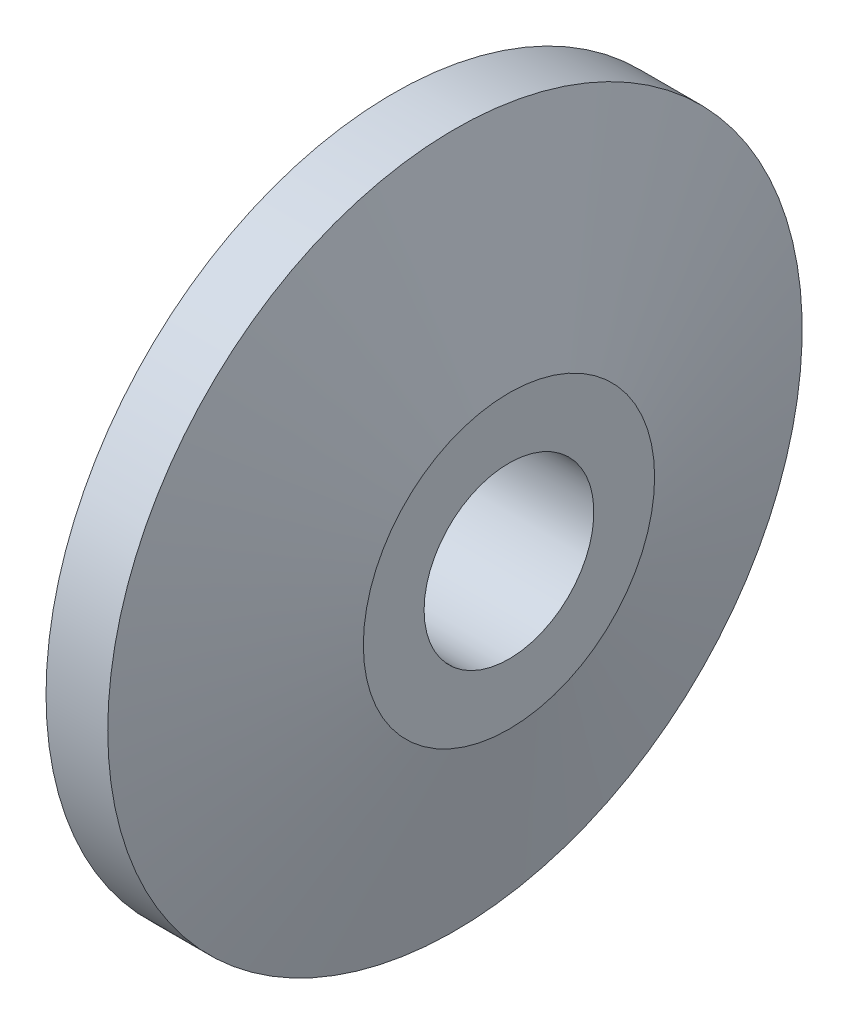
from build123d import *


with BuildPart() as part:
    # Esquisse1 → R_volution1 (revolve)
    with BuildSketch(Plane.XY, mode=Mode.PRIVATE) as r_volution1_sk:
        Polygon((0, 11), (28, 11), (28, 18.875644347), (21, 45), (13, 45), (13, 25), (0, 25), align=None)
    revolve(r_volution1_sk.sketch.rotate(Axis((0, 0, 0), (1, 0, 0)), 90), axis=Axis((0, 0, 0), (1, 0, 0)))


solid = part.part
